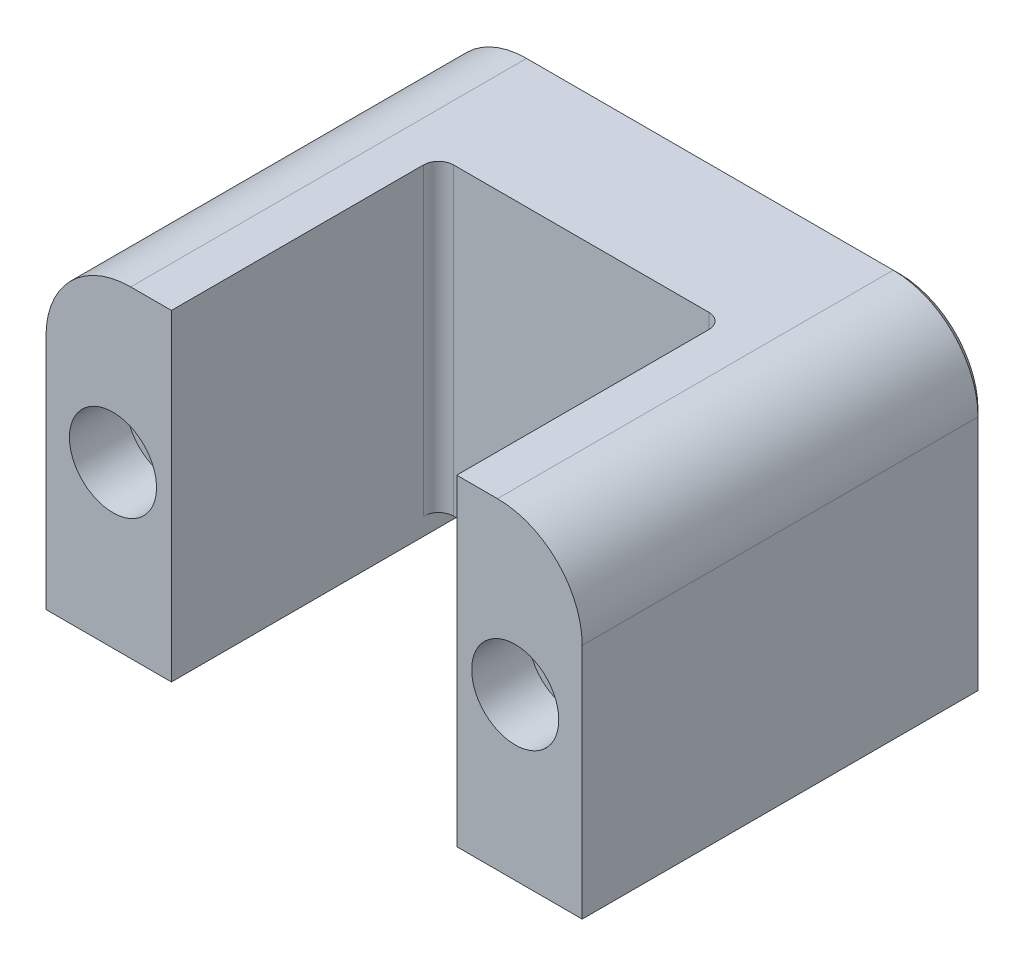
from build123d import *

# Parameters (mm, degrees)
EXTRUDE1_DEPTH     = 38.1
SKETCH3_W          = 33.782
SKETCH3_H          = 11.770125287
CUT_EXTRUDE2_DEPTH = 2.0828
FILLET3_R          = 2.032
FILLET4_R          = 1.778
FILLET5_R          = 10.033
CHAMFER1_SIZE      = 0.762


with BuildPart() as part:
    # Sketch1 → Extrude1 (new body)
    with BuildSketch(Plane(origin=(0, 0, 0), x_dir=(1, 0, 0), z_dir=(0, 1, 0))):
        Polygon((-31.74365, 0), (-16.891, 0), (-16.891, 31.623), (16.891, 31.623), (16.891, 0), (31.74365, 0), (31.74365, 47.625), (-31.74365, 47.625), align=None)
    extrude(amount=EXTRUDE1_DEPTH)

    # Sketch3 → Cut-Extrude2 (cut)
    with BuildSketch(Plane.XZ):
        with Locations((0, -34.627937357)):
            Rectangle(SKETCH3_W, SKETCH3_H)
    extrude(amount=-CUT_EXTRUDE2_DEPTH, mode=Mode.SUBTRACT)

    # Fillet3
    fillet3_edges = [part.edges().sort_by_distance(p)[0] for p in [
        (-16.891, 1.0414, -40.513),
        (16.891, 1.0414, -40.513),
    ]]
    fillet(fillet3_edges, radius=FILLET3_R)

    # Fillet4
    fillet4_edges = [part.edges().sort_by_distance(p)[0] for p in [
        (16.891, 20.0914, -31.623),
        (-16.891, 20.0914, -31.623),
    ]]
    fillet(fillet4_edges, radius=FILLET4_R)

    # Sketch4 → Cut-Revolve9 (revolve, cut)
    with BuildSketch(Plane(origin=(0, 19.05, 0), x_dir=(-1, 0, 0), z_dir=(0, 1, 0)), mode=Mode.PRIVATE) as cut_revolve9_sk:
        Polygon((23.8125, -47.625), (23.8125, 0), (18.6563, 0), (18.6563, -6.7564), (20.2438, -6.7564), (20.2438, -47.625), align=None)
    cut_revolve9 = revolve(cut_revolve9_sk.sketch.rotate(Axis((-23.8125, 19.05, -4.7498), (0, 0, 1)), 180), axis=Axis((-23.8125, 19.05, -4.7498), (0, 0, 1)), mode=Mode.SUBTRACT)

    # Mirror1: Cut-Revolve9 across plane
    add(cut_revolve9.mirror(Plane(origin=(0, 0, 0), x_dir=(0, 0, 1), z_dir=(1, 0, 0))), mode=Mode.SUBTRACT)

    # Fillet5
    fillet5_edges = [part.edges().sort_by_distance(p)[0] for p in [
        (31.74365, 38.1, -23.8125),
        (-31.74365, 38.1, -23.8125),
    ]]
    fillet(fillet5_edges, radius=FILLET5_R)

    # Chamfer1
    chamfer1_edges = [part.edges().sort_by_distance(p)[0] for p in [
        (0, 38.1, -47.625),
        (-31.74365, 14.0335, -47.625),
        (31.74365, 14.0335, -47.625),
        (-28.805052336, 35.161402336, -47.625),
        (28.805052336, 35.161402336, -47.625),
    ]]
    chamfer(chamfer1_edges, length=CHAMFER1_SIZE)


solid = part.part
